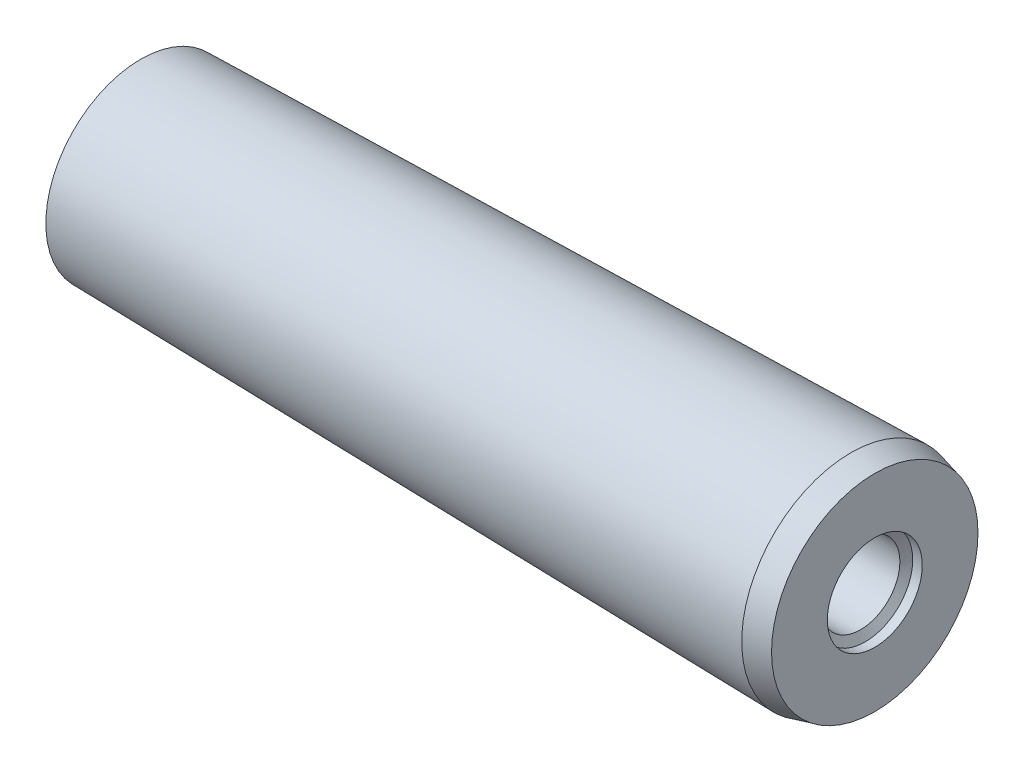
from build123d import *


with BuildPart() as part:
    # BodySke → BaseBody (revolve)
    with BuildSketch(Plane.XY):
        with BuildLine():
            Line((-200, 0), (-55.976729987, 0))
            Line((-55.976729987, 0), (-50, 10.352))
            Line((-50, 10.352), (-3.740148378, 10.352))
            Line((-3.740148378, 10.352), (-2.5, 12.5))
            Line((-2.5, 12.5), (0, 12.5))
            Line((0, 12.5), (0, 27.186272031))
            Line((0, 27.186272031), (-6.3, 28.740025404))
            Line((-6.3, 28.740025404), (-193.301270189, 25))
            ThreePointArc((-193.301270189, 25), (-198.296291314, 12.940952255), (-200, 0))
        make_face()
    revolve(axis=Axis((0, 0, 0), (-1, 0, 0)))


solid = part.part
